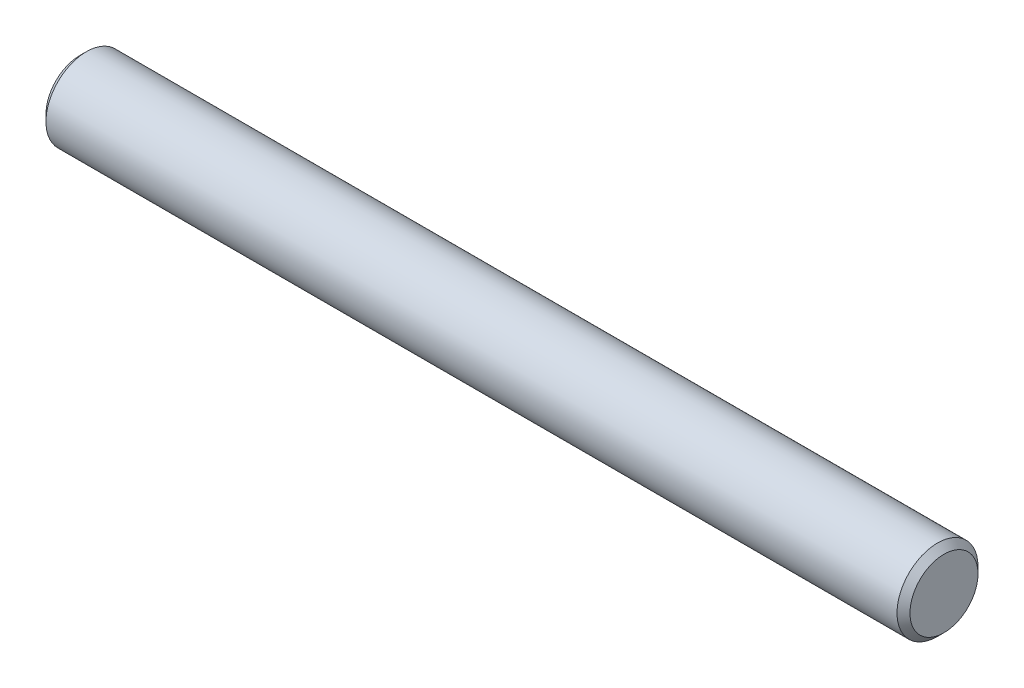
from build123d import *

# Parameters (mm, degrees)
SKETCH1_R      = 2.38125
EXTRUDE1_DEPTH = 50.8
CHAMFER1_SIZE  = 0.381


with BuildPart() as part:
    # Sketch1 → Extrude1 (new body)
    with BuildSketch(Plane(origin=(0, 0, 0), x_dir=(0, 0, -1), z_dir=(1, 0, 0))):
        Circle(SKETCH1_R)
    extrude(amount=EXTRUDE1_DEPTH)

    # Chamfer1
    chamfer1_edges = [part.edges().sort_by_distance(p)[0] for p in [
        (0, 0, 2.38125),
        (50.8, 0, 2.38125),
    ]]
    chamfer(chamfer1_edges, length=CHAMFER1_SIZE)


solid = part.part
